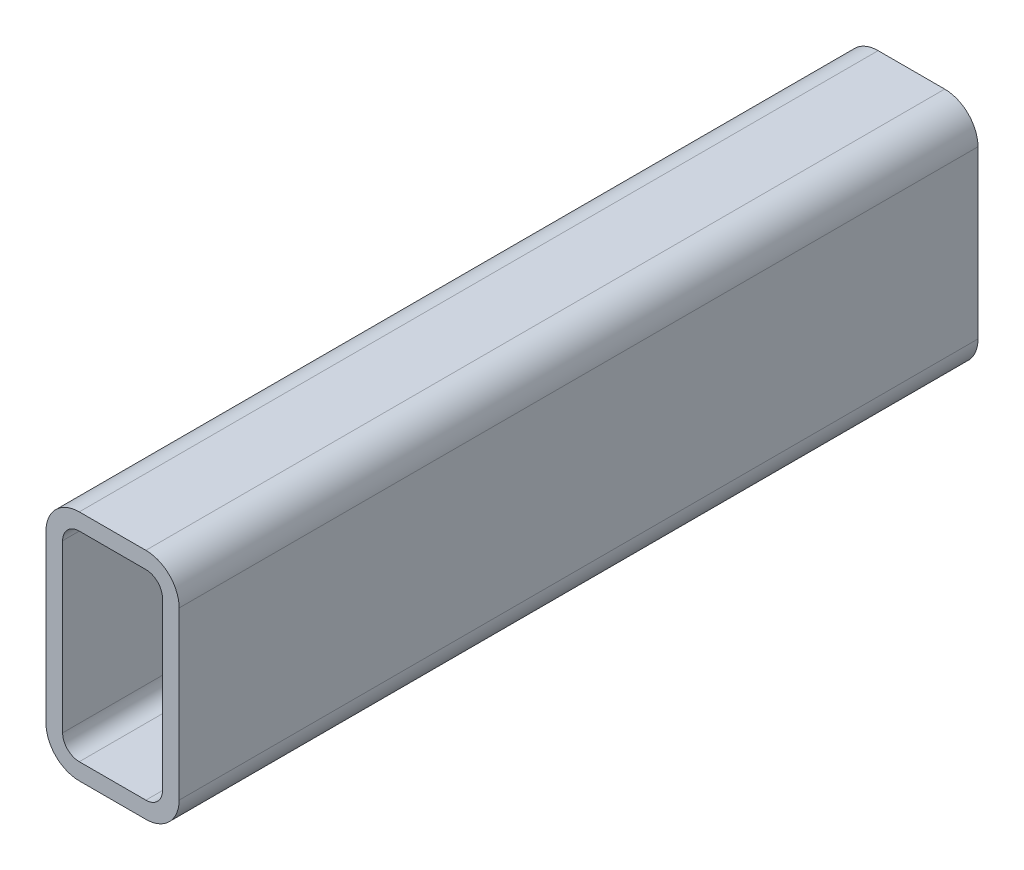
from build123d import *

# Parameters (mm, degrees)
BOSS_EXTRUDE1_DEPTH = 304.8


with BuildPart() as part:
    # Sketch1 → Boss-Extrude1 (new body)
    with BuildSketch(Plane.XY):
        with BuildLine():
            Line((12.7, 88.9), (38.1, 88.9))
            ThreePointArc((38.1, 88.9), (47.080256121, 85.180256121), (50.8, 76.2))
            Line((50.8, 76.2), (50.8, 12.7))
            ThreePointArc((50.8, 12.7), (47.080256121, 3.719743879), (38.1, 0))
            Line((38.1, 0), (12.7, 0))
            ThreePointArc((12.7, 0), (3.719743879, 3.719743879), (0, 12.7))
            Line((0, 12.7), (0, 76.2))
            ThreePointArc((0, 76.2), (3.719743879, 85.180256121), (12.7, 88.9))
        make_face()
        with BuildLine():
            Line((12.7, 82.55), (38.1, 82.55))
            ThreePointArc((38.1, 82.55), (42.590128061, 80.690128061), (44.45, 76.2))
            Line((44.45, 76.2), (44.45, 12.7))
            ThreePointArc((44.45, 12.7), (42.590128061, 8.209871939), (38.1, 6.35))
            Line((38.1, 6.35), (12.7, 6.35))
            ThreePointArc((12.7, 6.35), (8.209871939, 8.209871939), (6.35, 12.7))
            Line((6.35, 12.7), (6.35, 76.2))
            ThreePointArc((6.35, 76.2), (8.209871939, 80.690128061), (12.7, 82.55))
        make_face(mode=Mode.SUBTRACT)
    extrude(amount=BOSS_EXTRUDE1_DEPTH)


solid = part.part
